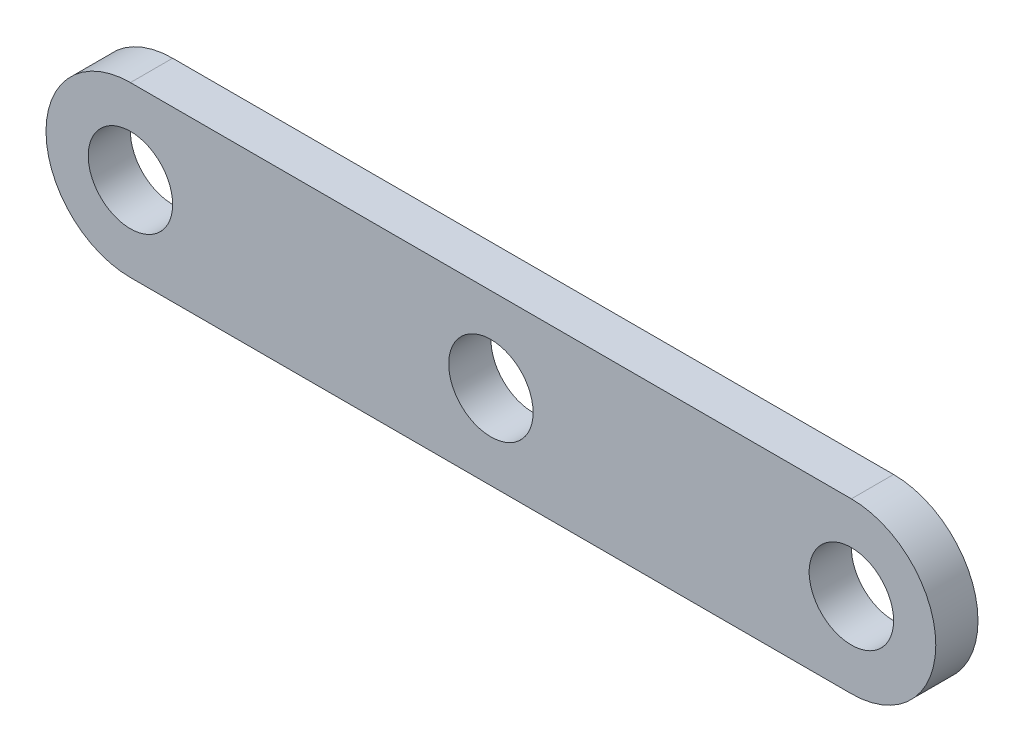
ISO-10303-21;
HEADER;
FILE_DESCRIPTION(('STEP AP214'),'2;1');
FILE_NAME('part.step','',(''),(''),'','','');
FILE_SCHEMA(('AUTOMOTIVE_DESIGN { 1 0 10303 214 1 1 1 1 }'));
ENDSEC;
DATA;
#1=APPLICATION_CONTEXT('core data for automotive mechanical design processes');
#2=APPLICATION_PROTOCOL_DEFINITION('international standard','automotive_design',2000,#1);
#3=PRODUCT_CONTEXT('',#1,'mechanical');
#4=PRODUCT('Part','Part','',(#3));
#5=PRODUCT_RELATED_PRODUCT_CATEGORY('part','',(#4));
#6=PRODUCT_DEFINITION_FORMATION('','',#4);
#7=PRODUCT_DEFINITION_CONTEXT('part definition',#1,'design');
#8=PRODUCT_DEFINITION('design','',#6,#7);
#9=PRODUCT_DEFINITION_SHAPE('','',#8);
#10=(LENGTH_UNIT() NAMED_UNIT(*) SI_UNIT(.MILLI.,.METRE.));
#11=(NAMED_UNIT(*) PLANE_ANGLE_UNIT() SI_UNIT($,.RADIAN.));
#12=(NAMED_UNIT(*) SI_UNIT($,.STERADIAN.) SOLID_ANGLE_UNIT());
#13=UNCERTAINTY_MEASURE_WITH_UNIT(LENGTH_MEASURE(1.E-05),#10,'distance_accuracy_value','');
#14=(GEOMETRIC_REPRESENTATION_CONTEXT(3) GLOBAL_UNCERTAINTY_ASSIGNED_CONTEXT((#13)) GLOBAL_UNIT_ASSIGNED_CONTEXT((#10,
#11,#12)) REPRESENTATION_CONTEXT('',''));
#15=CARTESIAN_POINT('',(0.,0.,0.));
#16=DIRECTION('',(0.,0.,1.));
#17=DIRECTION('',(1.,0.,0.));
#18=AXIS2_PLACEMENT_3D('',#15,#16,#17);
#19=CARTESIAN_POINT('',(0.,0.,6.35));
#20=DIRECTION('',(0.,0.,1.));
#21=DIRECTION('',(1.,0.,0.));
#22=AXIS2_PLACEMENT_3D('',#19,#20,#21);
#23=PLANE('',#22);
#24=CARTESIAN_POINT('',(108.458,0.,6.35));
#25=DIRECTION('',(0.,0.,1.));
#26=DIRECTION('',(1.,0.,0.));
#27=AXIS2_PLACEMENT_3D('',#24,#25,#26);
#28=CIRCLE('',#27,6.35);
#29=CARTESIAN_POINT('',(114.808,0.,6.35));
#30=VERTEX_POINT('',#29);
#31=EDGE_CURVE('E115',#30,#30,#28,.T.);
#32=ORIENTED_EDGE('',*,*,#31,.F.);
#33=EDGE_LOOP('',(#32));
#34=FACE_BOUND('',#33,.T.);
#35=CARTESIAN_POINT('',(0.,0.,6.35));
#36=DIRECTION('',(0.,0.,1.));
#37=DIRECTION('',(1.,0.,0.));
#38=AXIS2_PLACEMENT_3D('',#35,#36,#37);
#39=CIRCLE('',#38,12.7);
#40=CARTESIAN_POINT('',(0.,12.7,6.35));
#41=VERTEX_POINT('',#40);
#42=CARTESIAN_POINT('',(0.,-12.7,6.35));
#43=VERTEX_POINT('',#42);
#44=EDGE_CURVE('E85',#41,#43,#39,.T.);
#45=ORIENTED_EDGE('',*,*,#44,.T.);
#46=DIRECTION('',(1.,0.,0.));
#47=VECTOR('',#46,1.);
#48=CARTESIAN_POINT('',(0.,-12.7,6.35));
#49=LINE('',#48,#47);
#50=CARTESIAN_POINT('',(108.458,-12.7,6.35));
#51=VERTEX_POINT('',#50);
#52=EDGE_CURVE('E80',#43,#51,#49,.T.);
#53=ORIENTED_EDGE('',*,*,#52,.T.);
#54=CARTESIAN_POINT('',(108.458,0.,6.35));
#55=DIRECTION('',(0.,0.,1.));
#56=DIRECTION('',(1.,0.,0.));
#57=AXIS2_PLACEMENT_3D('',#54,#55,#56);
#58=CIRCLE('',#57,12.7);
#59=CARTESIAN_POINT('',(108.458,12.7,6.35));
#60=VERTEX_POINT('',#59);
#61=EDGE_CURVE('E83',#51,#60,#58,.T.);
#62=ORIENTED_EDGE('',*,*,#61,.T.);
#63=DIRECTION('',(-1.,0.,0.));
#64=VECTOR('',#63,1.);
#65=CARTESIAN_POINT('',(0.,12.7,6.35));
#66=LINE('',#65,#64);
#67=EDGE_CURVE('E50',#60,#41,#66,.T.);
#68=ORIENTED_EDGE('',*,*,#67,.T.);
#69=EDGE_LOOP('',(#45,#53,#62,#68));
#70=FACE_BOUND('',#69,.T.);
#71=CARTESIAN_POINT('',(0.,0.,6.35));
#72=DIRECTION('',(0.,0.,1.));
#73=DIRECTION('',(1.,0.,0.));
#74=AXIS2_PLACEMENT_3D('',#71,#72,#73);
#75=CIRCLE('',#74,6.35);
#76=CARTESIAN_POINT('',(6.35,0.,6.35));
#77=VERTEX_POINT('',#76);
#78=EDGE_CURVE('E100',#77,#77,#75,.T.);
#79=ORIENTED_EDGE('',*,*,#78,.F.);
#80=EDGE_LOOP('',(#79));
#81=FACE_BOUND('',#80,.T.);
#82=CARTESIAN_POINT('',(54.229,0.,6.35));
#83=DIRECTION('',(0.,0.,1.));
#84=DIRECTION('',(1.,0.,0.));
#85=AXIS2_PLACEMENT_3D('',#82,#83,#84);
#86=CIRCLE('',#85,6.35);
#87=CARTESIAN_POINT('',(60.579,0.,6.35));
#88=VERTEX_POINT('',#87);
#89=EDGE_CURVE('E121',#88,#88,#86,.T.);
#90=ORIENTED_EDGE('',*,*,#89,.F.);
#91=EDGE_LOOP('',(#90));
#92=FACE_BOUND('',#91,.T.);
#93=ADVANCED_FACE('F33',(#34,#70,#81,#92),#23,.T.);
#94=CARTESIAN_POINT('',(0.,0.,0.));
#95=DIRECTION('',(0.,0.,1.));
#96=DIRECTION('',(1.,0.,0.));
#97=AXIS2_PLACEMENT_3D('',#94,#95,#96);
#98=PLANE('',#97);
#99=CARTESIAN_POINT('',(0.,0.,0.));
#100=DIRECTION('',(0.,0.,1.));
#101=DIRECTION('',(1.,0.,0.));
#102=AXIS2_PLACEMENT_3D('',#99,#100,#101);
#103=CIRCLE('',#102,12.7);
#104=CARTESIAN_POINT('',(0.,12.7,0.));
#105=VERTEX_POINT('',#104);
#106=CARTESIAN_POINT('',(0.,-12.7,0.));
#107=VERTEX_POINT('',#106);
#108=EDGE_CURVE('E97',#105,#107,#103,.T.);
#109=ORIENTED_EDGE('',*,*,#108,.F.);
#110=DIRECTION('',(-1.,0.,0.));
#111=VECTOR('',#110,1.);
#112=CARTESIAN_POINT('',(0.,12.7,0.));
#113=LINE('',#112,#111);
#114=CARTESIAN_POINT('',(108.458,12.7,0.));
#115=VERTEX_POINT('',#114);
#116=EDGE_CURVE('E73',#115,#105,#113,.T.);
#117=ORIENTED_EDGE('',*,*,#116,.F.);
#118=CARTESIAN_POINT('',(108.458,0.,0.));
#119=DIRECTION('',(0.,0.,1.));
#120=DIRECTION('',(1.,0.,0.));
#121=AXIS2_PLACEMENT_3D('',#118,#119,#120);
#122=CIRCLE('',#121,12.7);
#123=CARTESIAN_POINT('',(108.458,-12.7,0.));
#124=VERTEX_POINT('',#123);
#125=EDGE_CURVE('E67',#124,#115,#122,.T.);
#126=ORIENTED_EDGE('',*,*,#125,.F.);
#127=DIRECTION('',(1.,0.,0.));
#128=VECTOR('',#127,1.);
#129=CARTESIAN_POINT('',(0.,-12.7,0.));
#130=LINE('',#129,#128);
#131=EDGE_CURVE('E89',#107,#124,#130,.T.);
#132=ORIENTED_EDGE('',*,*,#131,.F.);
#133=EDGE_LOOP('',(#109,#117,#126,#132));
#134=FACE_BOUND('',#133,.T.);
#135=CARTESIAN_POINT('',(0.,0.,0.));
#136=DIRECTION('',(0.,0.,1.));
#137=DIRECTION('',(1.,0.,0.));
#138=AXIS2_PLACEMENT_3D('',#135,#136,#137);
#139=CIRCLE('',#138,6.35);
#140=CARTESIAN_POINT('',(6.35,0.,0.));
#141=VERTEX_POINT('',#140);
#142=EDGE_CURVE('E112',#141,#141,#139,.T.);
#143=ORIENTED_EDGE('',*,*,#142,.T.);
#144=EDGE_LOOP('',(#143));
#145=FACE_BOUND('',#144,.T.);
#146=CARTESIAN_POINT('',(108.458,0.,0.));
#147=DIRECTION('',(0.,0.,1.));
#148=DIRECTION('',(1.,0.,0.));
#149=AXIS2_PLACEMENT_3D('',#146,#147,#148);
#150=CIRCLE('',#149,6.35);
#151=CARTESIAN_POINT('',(114.808,0.,0.));
#152=VERTEX_POINT('',#151);
#153=EDGE_CURVE('E118',#152,#152,#150,.T.);
#154=ORIENTED_EDGE('',*,*,#153,.T.);
#155=EDGE_LOOP('',(#154));
#156=FACE_BOUND('',#155,.T.);
#157=CARTESIAN_POINT('',(54.229,0.,0.));
#158=DIRECTION('',(0.,0.,1.));
#159=DIRECTION('',(1.,0.,0.));
#160=AXIS2_PLACEMENT_3D('',#157,#158,#159);
#161=CIRCLE('',#160,6.35);
#162=CARTESIAN_POINT('',(60.579,0.,0.));
#163=VERTEX_POINT('',#162);
#164=EDGE_CURVE('E124',#163,#163,#161,.T.);
#165=ORIENTED_EDGE('',*,*,#164,.T.);
#166=EDGE_LOOP('',(#165));
#167=FACE_BOUND('',#166,.T.);
#168=ADVANCED_FACE('F108',(#134,#145,#156,#167),#98,.F.);
#169=CARTESIAN_POINT('',(0.,0.,6.35));
#170=DIRECTION('',(0.,0.,-1.));
#171=DIRECTION('',(-1.,0.,0.));
#172=AXIS2_PLACEMENT_3D('',#169,#170,#171);
#173=CYLINDRICAL_SURFACE('',#172,12.7);
#174=ORIENTED_EDGE('',*,*,#108,.T.);
#175=DIRECTION('',(0.,0.,-1.));
#176=VECTOR('',#175,1.);
#177=CARTESIAN_POINT('',(0.,-12.7,6.35));
#178=LINE('',#177,#176);
#179=EDGE_CURVE('E11',#43,#107,#178,.T.);
#180=ORIENTED_EDGE('',*,*,#179,.F.);
#181=ORIENTED_EDGE('',*,*,#44,.F.);
#182=DIRECTION('',(0.,0.,-1.));
#183=VECTOR('',#182,1.);
#184=CARTESIAN_POINT('',(0.,12.7,6.35));
#185=LINE('',#184,#183);
#186=EDGE_CURVE('E93',#41,#105,#185,.T.);
#187=ORIENTED_EDGE('',*,*,#186,.T.);
#188=EDGE_LOOP('',(#174,#180,#181,#187));
#189=FACE_BOUND('',#188,.T.);
#190=ADVANCED_FACE('F35',(#189),#173,.T.);
#191=CARTESIAN_POINT('',(0.,-12.7,6.35));
#192=DIRECTION('',(0.,1.,0.));
#193=DIRECTION('',(0.,0.,1.));
#194=AXIS2_PLACEMENT_3D('',#191,#192,#193);
#195=PLANE('',#194);
#196=ORIENTED_EDGE('',*,*,#131,.T.);
#197=DIRECTION('',(0.,0.,-1.));
#198=VECTOR('',#197,1.);
#199=CARTESIAN_POINT('',(108.458,-12.7,6.35));
#200=LINE('',#199,#198);
#201=EDGE_CURVE('E42',#51,#124,#200,.T.);
#202=ORIENTED_EDGE('',*,*,#201,.F.);
#203=ORIENTED_EDGE('',*,*,#52,.F.);
#204=ORIENTED_EDGE('',*,*,#179,.T.);
#205=EDGE_LOOP('',(#196,#202,#203,#204));
#206=FACE_BOUND('',#205,.T.);
#207=ADVANCED_FACE('F88',(#206),#195,.F.);
#208=CARTESIAN_POINT('',(108.458,0.,6.35));
#209=DIRECTION('',(0.,0.,-1.));
#210=DIRECTION('',(-1.,0.,0.));
#211=AXIS2_PLACEMENT_3D('',#208,#209,#210);
#212=CYLINDRICAL_SURFACE('',#211,12.7);
#213=ORIENTED_EDGE('',*,*,#125,.T.);
#214=DIRECTION('',(0.,0.,-1.));
#215=VECTOR('',#214,1.);
#216=CARTESIAN_POINT('',(108.458,12.7,6.35));
#217=LINE('',#216,#215);
#218=EDGE_CURVE('E90',#60,#115,#217,.T.);
#219=ORIENTED_EDGE('',*,*,#218,.F.);
#220=ORIENTED_EDGE('',*,*,#61,.F.);
#221=ORIENTED_EDGE('',*,*,#201,.T.);
#222=EDGE_LOOP('',(#213,#219,#220,#221));
#223=FACE_BOUND('',#222,.T.);
#224=ADVANCED_FACE('F91',(#223),#212,.T.);
#225=CARTESIAN_POINT('',(0.,12.7,6.35));
#226=DIRECTION('',(0.,-1.,0.));
#227=DIRECTION('',(0.,0.,-1.));
#228=AXIS2_PLACEMENT_3D('',#225,#226,#227);
#229=PLANE('',#228);
#230=ORIENTED_EDGE('',*,*,#116,.T.);
#231=ORIENTED_EDGE('',*,*,#186,.F.);
#232=ORIENTED_EDGE('',*,*,#67,.F.);
#233=ORIENTED_EDGE('',*,*,#218,.T.);
#234=EDGE_LOOP('',(#230,#231,#232,#233));
#235=FACE_BOUND('',#234,.T.);
#236=ADVANCED_FACE('F105',(#235),#229,.F.);
#237=CARTESIAN_POINT('',(0.,0.,6.35));
#238=DIRECTION('',(0.,0.,-1.));
#239=DIRECTION('',(-1.,0.,0.));
#240=AXIS2_PLACEMENT_3D('',#237,#238,#239);
#241=CYLINDRICAL_SURFACE('',#240,6.35);
#242=ORIENTED_EDGE('',*,*,#78,.T.);
#243=EDGE_LOOP('',(#242));
#244=FACE_BOUND('',#243,.T.);
#245=ORIENTED_EDGE('',*,*,#142,.F.);
#246=EDGE_LOOP('',(#245));
#247=FACE_BOUND('',#246,.T.);
#248=ADVANCED_FACE('F142',(#244,#247),#241,.F.);
#249=CARTESIAN_POINT('',(108.458,0.,6.35));
#250=DIRECTION('',(0.,0.,-1.));
#251=DIRECTION('',(-1.,0.,0.));
#252=AXIS2_PLACEMENT_3D('',#249,#250,#251);
#253=CYLINDRICAL_SURFACE('',#252,6.35);
#254=ORIENTED_EDGE('',*,*,#31,.T.);
#255=EDGE_LOOP('',(#254));
#256=FACE_BOUND('',#255,.T.);
#257=ORIENTED_EDGE('',*,*,#153,.F.);
#258=EDGE_LOOP('',(#257));
#259=FACE_BOUND('',#258,.T.);
#260=ADVANCED_FACE('F188',(#256,#259),#253,.F.);
#261=CARTESIAN_POINT('',(54.229,0.,6.35));
#262=DIRECTION('',(0.,0.,-1.));
#263=DIRECTION('',(-1.,0.,0.));
#264=AXIS2_PLACEMENT_3D('',#261,#262,#263);
#265=CYLINDRICAL_SURFACE('',#264,6.35);
#266=ORIENTED_EDGE('',*,*,#89,.T.);
#267=EDGE_LOOP('',(#266));
#268=FACE_BOUND('',#267,.T.);
#269=ORIENTED_EDGE('',*,*,#164,.F.);
#270=EDGE_LOOP('',(#269));
#271=FACE_BOUND('',#270,.T.);
#272=ADVANCED_FACE('F130',(#268,#271),#265,.F.);
#273=CLOSED_SHELL('',(#93,#168,#190,#207,#224,#236,#248,#260,#272));
#274=MANIFOLD_SOLID_BREP('B2',#273);
#275=ADVANCED_BREP_SHAPE_REPRESENTATION('',(#18,#274),#14);
#276=SHAPE_DEFINITION_REPRESENTATION(#9,#275);
ENDSEC;
END-ISO-10303-21;
